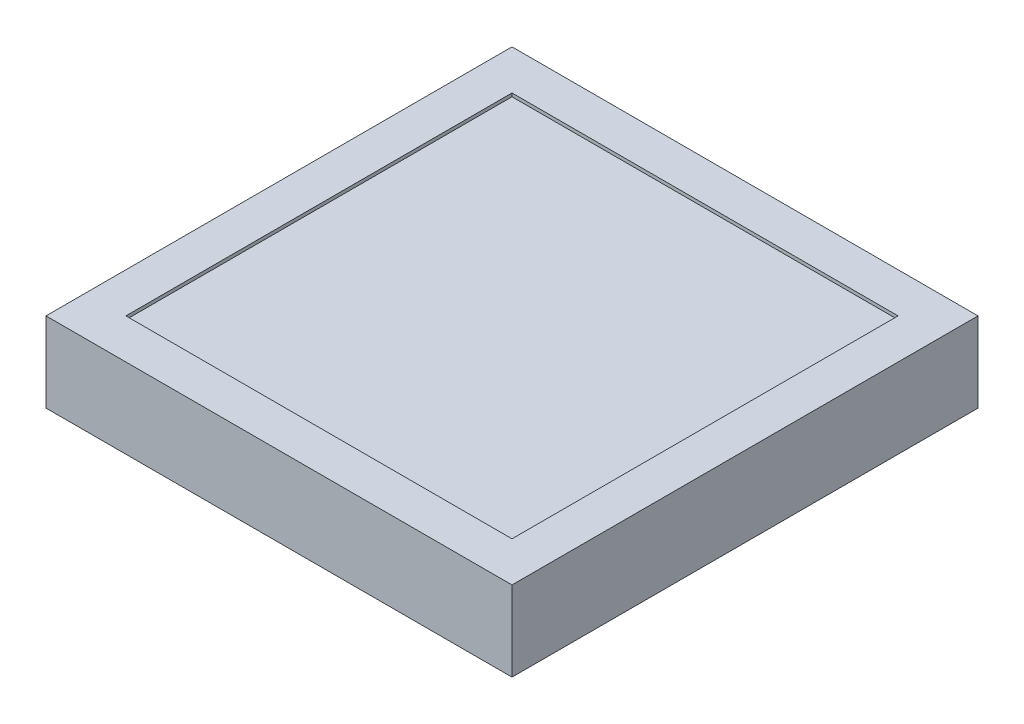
ISO-10303-21;
HEADER;
FILE_DESCRIPTION(('STEP AP214'),'2;1');
FILE_NAME('part.step','',(''),(''),'','','');
FILE_SCHEMA(('AUTOMOTIVE_DESIGN { 1 0 10303 214 1 1 1 1 }'));
ENDSEC;
DATA;
#1=APPLICATION_CONTEXT('core data for automotive mechanical design processes');
#2=APPLICATION_PROTOCOL_DEFINITION('international standard','automotive_design',2000,#1);
#3=PRODUCT_CONTEXT('',#1,'mechanical');
#4=PRODUCT('Part','Part','',(#3));
#5=PRODUCT_RELATED_PRODUCT_CATEGORY('part','',(#4));
#6=PRODUCT_DEFINITION_FORMATION('','',#4);
#7=PRODUCT_DEFINITION_CONTEXT('part definition',#1,'design');
#8=PRODUCT_DEFINITION('design','',#6,#7);
#9=PRODUCT_DEFINITION_SHAPE('','',#8);
#10=(LENGTH_UNIT() NAMED_UNIT(*) SI_UNIT(.MILLI.,.METRE.));
#11=(NAMED_UNIT(*) PLANE_ANGLE_UNIT() SI_UNIT($,.RADIAN.));
#12=(NAMED_UNIT(*) SI_UNIT($,.STERADIAN.) SOLID_ANGLE_UNIT());
#13=UNCERTAINTY_MEASURE_WITH_UNIT(LENGTH_MEASURE(1.E-05),#10,'distance_accuracy_value','');
#14=(GEOMETRIC_REPRESENTATION_CONTEXT(3) GLOBAL_UNCERTAINTY_ASSIGNED_CONTEXT((#13)) GLOBAL_UNIT_ASSIGNED_CONTEXT((#10,
#11,#12)) REPRESENTATION_CONTEXT('',''));
#15=CARTESIAN_POINT('',(0.,0.,0.));
#16=DIRECTION('',(0.,0.,1.));
#17=DIRECTION('',(1.,0.,0.));
#18=AXIS2_PLACEMENT_3D('',#15,#16,#17);
#19=CARTESIAN_POINT('',(144.143471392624,24.,145.254894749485));
#20=DIRECTION('',(-1.,0.,0.));
#21=DIRECTION('',(0.,0.,1.));
#22=AXIS2_PLACEMENT_3D('',#19,#20,#21);
#23=PLANE('',#22);
#24=DIRECTION('',(0.,0.,-1.));
#25=VECTOR('',#24,1.);
#26=CARTESIAN_POINT('',(144.143471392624,0.,145.254894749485));
#27=LINE('',#26,#25);
#28=CARTESIAN_POINT('',(144.143471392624,0.,145.254894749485));
#29=VERTEX_POINT('',#28);
#30=CARTESIAN_POINT('',(144.143471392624,0.,5.25489474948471));
#31=VERTEX_POINT('',#30);
#32=EDGE_CURVE('E158',#29,#31,#27,.T.);
#33=ORIENTED_EDGE('',*,*,#32,.T.);
#34=DIRECTION('',(0.,-1.,0.));
#35=VECTOR('',#34,1.);
#36=CARTESIAN_POINT('',(144.143471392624,24.,5.25489474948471));
#37=LINE('',#36,#35);
#38=CARTESIAN_POINT('',(144.143471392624,24.,5.25489474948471));
#39=VERTEX_POINT('',#38);
#40=EDGE_CURVE('E11',#39,#31,#37,.T.);
#41=ORIENTED_EDGE('',*,*,#40,.F.);
#42=DIRECTION('',(0.,0.,-1.));
#43=VECTOR('',#42,1.);
#44=CARTESIAN_POINT('',(144.143471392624,24.,145.254894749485));
#45=LINE('',#44,#43);
#46=CARTESIAN_POINT('',(144.143471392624,24.,145.254894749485));
#47=VERTEX_POINT('',#46);
#48=EDGE_CURVE('E164',#47,#39,#45,.T.);
#49=ORIENTED_EDGE('',*,*,#48,.F.);
#50=DIRECTION('',(0.,-1.,0.));
#51=VECTOR('',#50,1.);
#52=CARTESIAN_POINT('',(144.143471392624,24.,145.254894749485));
#53=LINE('',#52,#51);
#54=EDGE_CURVE('E174',#47,#29,#53,.T.);
#55=ORIENTED_EDGE('',*,*,#54,.T.);
#56=EDGE_LOOP('',(#33,#41,#49,#55));
#57=FACE_BOUND('',#56,.T.);
#58=ADVANCED_FACE('F39',(#57),#23,.F.);
#59=CARTESIAN_POINT('',(4.14347139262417,24.,5.25489474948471));
#60=DIRECTION('',(0.,0.,1.));
#61=DIRECTION('',(1.,0.,0.));
#62=AXIS2_PLACEMENT_3D('',#59,#60,#61);
#63=PLANE('',#62);
#64=DIRECTION('',(-1.,0.,0.));
#65=VECTOR('',#64,1.);
#66=CARTESIAN_POINT('',(4.14347139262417,0.,5.25489474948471));
#67=LINE('',#66,#65);
#68=CARTESIAN_POINT('',(4.14347139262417,0.,5.25489474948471));
#69=VERTEX_POINT('',#68);
#70=EDGE_CURVE('E178',#31,#69,#67,.T.);
#71=ORIENTED_EDGE('',*,*,#70,.T.);
#72=DIRECTION('',(0.,-1.,0.));
#73=VECTOR('',#72,1.);
#74=CARTESIAN_POINT('',(4.14347139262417,24.,5.25489474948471));
#75=LINE('',#74,#73);
#76=CARTESIAN_POINT('',(4.14347139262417,24.,5.25489474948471));
#77=VERTEX_POINT('',#76);
#78=EDGE_CURVE('E47',#77,#69,#75,.T.);
#79=ORIENTED_EDGE('',*,*,#78,.F.);
#80=DIRECTION('',(-1.,0.,0.));
#81=VECTOR('',#80,1.);
#82=CARTESIAN_POINT('',(4.14347139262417,24.,5.25489474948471));
#83=LINE('',#82,#81);
#84=EDGE_CURVE('E91',#39,#77,#83,.T.);
#85=ORIENTED_EDGE('',*,*,#84,.F.);
#86=ORIENTED_EDGE('',*,*,#40,.T.);
#87=EDGE_LOOP('',(#71,#79,#85,#86));
#88=FACE_BOUND('',#87,.T.);
#89=ADVANCED_FACE('F213',(#88),#63,.F.);
#90=CARTESIAN_POINT('',(4.14347139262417,24.,145.254894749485));
#91=DIRECTION('',(1.,0.,0.));
#92=DIRECTION('',(0.,0.,-1.));
#93=AXIS2_PLACEMENT_3D('',#90,#91,#92);
#94=PLANE('',#93);
#95=DIRECTION('',(0.,0.,1.));
#96=VECTOR('',#95,1.);
#97=CARTESIAN_POINT('',(4.14347139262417,0.,145.254894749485));
#98=LINE('',#97,#96);
#99=CARTESIAN_POINT('',(4.14347139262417,0.,145.254894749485));
#100=VERTEX_POINT('',#99);
#101=EDGE_CURVE('E181',#69,#100,#98,.T.);
#102=ORIENTED_EDGE('',*,*,#101,.T.);
#103=DIRECTION('',(0.,-1.,0.));
#104=VECTOR('',#103,1.);
#105=CARTESIAN_POINT('',(4.14347139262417,24.,145.254894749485));
#106=LINE('',#105,#104);
#107=CARTESIAN_POINT('',(4.14347139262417,24.,145.254894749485));
#108=VERTEX_POINT('',#107);
#109=EDGE_CURVE('E188',#108,#100,#106,.T.);
#110=ORIENTED_EDGE('',*,*,#109,.F.);
#111=DIRECTION('',(0.,0.,1.));
#112=VECTOR('',#111,1.);
#113=CARTESIAN_POINT('',(4.14347139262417,24.,145.254894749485));
#114=LINE('',#113,#112);
#115=EDGE_CURVE('E169',#77,#108,#114,.T.);
#116=ORIENTED_EDGE('',*,*,#115,.F.);
#117=ORIENTED_EDGE('',*,*,#78,.T.);
#118=EDGE_LOOP('',(#102,#110,#116,#117));
#119=FACE_BOUND('',#118,.T.);
#120=ADVANCED_FACE('F195',(#119),#94,.F.);
#121=CARTESIAN_POINT('',(4.14347139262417,24.,145.254894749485));
#122=DIRECTION('',(0.,0.,-1.));
#123=DIRECTION('',(-1.,0.,0.));
#124=AXIS2_PLACEMENT_3D('',#121,#122,#123);
#125=PLANE('',#124);
#126=DIRECTION('',(1.,0.,0.));
#127=VECTOR('',#126,1.);
#128=CARTESIAN_POINT('',(4.14347139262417,0.,145.254894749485));
#129=LINE('',#128,#127);
#130=EDGE_CURVE('E84',#100,#29,#129,.T.);
#131=ORIENTED_EDGE('',*,*,#130,.T.);
#132=ORIENTED_EDGE('',*,*,#54,.F.);
#133=DIRECTION('',(1.,0.,0.));
#134=VECTOR('',#133,1.);
#135=CARTESIAN_POINT('',(4.14347139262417,24.,145.254894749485));
#136=LINE('',#135,#134);
#137=EDGE_CURVE('E63',#108,#47,#136,.T.);
#138=ORIENTED_EDGE('',*,*,#137,.F.);
#139=ORIENTED_EDGE('',*,*,#109,.T.);
#140=EDGE_LOOP('',(#131,#132,#138,#139));
#141=FACE_BOUND('',#140,.T.);
#142=ADVANCED_FACE('F203',(#141),#125,.F.);
#143=CARTESIAN_POINT('',(0.,24.,0.));
#144=DIRECTION('',(0.,-1.,0.));
#145=DIRECTION('',(0.,0.,-1.));
#146=AXIS2_PLACEMENT_3D('',#143,#144,#145);
#147=PLANE('',#146);
#148=DIRECTION('',(-1.,0.,0.));
#149=VECTOR('',#148,1.);
#150=CARTESIAN_POINT('',(16.1434713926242,24.,17.2548947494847));
#151=LINE('',#150,#149);
#152=CARTESIAN_POINT('',(132.143471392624,24.,17.2548947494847));
#153=VERTEX_POINT('',#152);
#154=CARTESIAN_POINT('',(16.1434713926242,24.,17.2548947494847));
#155=VERTEX_POINT('',#154);
#156=EDGE_CURVE('E149',#153,#155,#151,.T.);
#157=ORIENTED_EDGE('',*,*,#156,.F.);
#158=DIRECTION('',(0.,0.,-1.));
#159=VECTOR('',#158,1.);
#160=CARTESIAN_POINT('',(132.143471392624,24.,133.254894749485));
#161=LINE('',#160,#159);
#162=CARTESIAN_POINT('',(132.143471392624,24.,133.254894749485));
#163=VERTEX_POINT('',#162);
#164=EDGE_CURVE('E54',#163,#153,#161,.T.);
#165=ORIENTED_EDGE('',*,*,#164,.F.);
#166=DIRECTION('',(1.,0.,0.));
#167=VECTOR('',#166,1.);
#168=CARTESIAN_POINT('',(16.1434713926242,24.,133.254894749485));
#169=LINE('',#168,#167);
#170=CARTESIAN_POINT('',(16.1434713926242,24.,133.254894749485));
#171=VERTEX_POINT('',#170);
#172=EDGE_CURVE('E136',#171,#163,#169,.T.);
#173=ORIENTED_EDGE('',*,*,#172,.F.);
#174=DIRECTION('',(0.,0.,1.));
#175=VECTOR('',#174,1.);
#176=CARTESIAN_POINT('',(16.1434713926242,24.,133.254894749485));
#177=LINE('',#176,#175);
#178=EDGE_CURVE('E140',#155,#171,#177,.T.);
#179=ORIENTED_EDGE('',*,*,#178,.F.);
#180=EDGE_LOOP('',(#157,#165,#173,#179));
#181=FACE_BOUND('',#180,.T.);
#182=ORIENTED_EDGE('',*,*,#48,.T.);
#183=ORIENTED_EDGE('',*,*,#84,.T.);
#184=ORIENTED_EDGE('',*,*,#115,.T.);
#185=ORIENTED_EDGE('',*,*,#137,.T.);
#186=EDGE_LOOP('',(#182,#183,#184,#185));
#187=FACE_BOUND('',#186,.T.);
#188=ADVANCED_FACE('F205',(#181,#187),#147,.F.);
#189=CARTESIAN_POINT('',(0.,0.,0.));
#190=DIRECTION('',(0.,-1.,0.));
#191=DIRECTION('',(0.,0.,-1.));
#192=AXIS2_PLACEMENT_3D('',#189,#190,#191);
#193=PLANE('',#192);
#194=ORIENTED_EDGE('',*,*,#32,.F.);
#195=ORIENTED_EDGE('',*,*,#130,.F.);
#196=ORIENTED_EDGE('',*,*,#101,.F.);
#197=ORIENTED_EDGE('',*,*,#70,.F.);
#198=EDGE_LOOP('',(#194,#195,#196,#197));
#199=FACE_BOUND('',#198,.T.);
#200=ADVANCED_FACE('F199',(#199),#193,.T.);
#201=CARTESIAN_POINT('',(132.143471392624,23.,133.254894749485));
#202=DIRECTION('',(1.,0.,0.));
#203=DIRECTION('',(0.,0.,-1.));
#204=AXIS2_PLACEMENT_3D('',#201,#202,#203);
#205=PLANE('',#204);
#206=ORIENTED_EDGE('',*,*,#164,.T.);
#207=DIRECTION('',(0.,1.,0.));
#208=VECTOR('',#207,1.);
#209=CARTESIAN_POINT('',(132.143471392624,23.,17.2548947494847));
#210=LINE('',#209,#208);
#211=CARTESIAN_POINT('',(132.143471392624,23.,17.2548947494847));
#212=VERTEX_POINT('',#211);
#213=EDGE_CURVE('E111',#212,#153,#210,.T.);
#214=ORIENTED_EDGE('',*,*,#213,.F.);
#215=DIRECTION('',(0.,0.,-1.));
#216=VECTOR('',#215,1.);
#217=CARTESIAN_POINT('',(132.143471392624,23.,133.254894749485));
#218=LINE('',#217,#216);
#219=CARTESIAN_POINT('',(132.143471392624,23.,133.254894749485));
#220=VERTEX_POINT('',#219);
#221=EDGE_CURVE('E115',#220,#212,#218,.T.);
#222=ORIENTED_EDGE('',*,*,#221,.F.);
#223=DIRECTION('',(0.,1.,0.));
#224=VECTOR('',#223,1.);
#225=CARTESIAN_POINT('',(132.143471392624,23.,133.254894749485));
#226=LINE('',#225,#224);
#227=EDGE_CURVE('E155',#220,#163,#226,.T.);
#228=ORIENTED_EDGE('',*,*,#227,.T.);
#229=EDGE_LOOP('',(#206,#214,#222,#228));
#230=FACE_BOUND('',#229,.T.);
#231=ADVANCED_FACE('F113',(#230),#205,.F.);
#232=CARTESIAN_POINT('',(16.1434713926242,23.,133.254894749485));
#233=DIRECTION('',(0.,0.,1.));
#234=DIRECTION('',(1.,0.,0.));
#235=AXIS2_PLACEMENT_3D('',#232,#233,#234);
#236=PLANE('',#235);
#237=ORIENTED_EDGE('',*,*,#172,.T.);
#238=ORIENTED_EDGE('',*,*,#227,.F.);
#239=DIRECTION('',(1.,0.,0.));
#240=VECTOR('',#239,1.);
#241=CARTESIAN_POINT('',(16.1434713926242,23.,133.254894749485));
#242=LINE('',#241,#240);
#243=CARTESIAN_POINT('',(16.1434713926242,23.,133.254894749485));
#244=VERTEX_POINT('',#243);
#245=EDGE_CURVE('E122',#244,#220,#242,.T.);
#246=ORIENTED_EDGE('',*,*,#245,.F.);
#247=DIRECTION('',(0.,1.,0.));
#248=VECTOR('',#247,1.);
#249=CARTESIAN_POINT('',(16.1434713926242,23.,133.254894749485));
#250=LINE('',#249,#248);
#251=EDGE_CURVE('E159',#244,#171,#250,.T.);
#252=ORIENTED_EDGE('',*,*,#251,.T.);
#253=EDGE_LOOP('',(#237,#238,#246,#252));
#254=FACE_BOUND('',#253,.T.);
#255=ADVANCED_FACE('F252',(#254),#236,.F.);
#256=CARTESIAN_POINT('',(16.1434713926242,23.,133.254894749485));
#257=DIRECTION('',(-1.,0.,0.));
#258=DIRECTION('',(0.,0.,1.));
#259=AXIS2_PLACEMENT_3D('',#256,#257,#258);
#260=PLANE('',#259);
#261=ORIENTED_EDGE('',*,*,#178,.T.);
#262=ORIENTED_EDGE('',*,*,#251,.F.);
#263=DIRECTION('',(0.,0.,1.));
#264=VECTOR('',#263,1.);
#265=CARTESIAN_POINT('',(16.1434713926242,23.,133.254894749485));
#266=LINE('',#265,#264);
#267=CARTESIAN_POINT('',(16.1434713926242,23.,17.2548947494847));
#268=VERTEX_POINT('',#267);
#269=EDGE_CURVE('E131',#268,#244,#266,.T.);
#270=ORIENTED_EDGE('',*,*,#269,.F.);
#271=DIRECTION('',(0.,1.,0.));
#272=VECTOR('',#271,1.);
#273=CARTESIAN_POINT('',(16.1434713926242,23.,17.2548947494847));
#274=LINE('',#273,#272);
#275=EDGE_CURVE('E121',#268,#155,#274,.T.);
#276=ORIENTED_EDGE('',*,*,#275,.T.);
#277=EDGE_LOOP('',(#261,#262,#270,#276));
#278=FACE_BOUND('',#277,.T.);
#279=ADVANCED_FACE('F261',(#278),#260,.F.);
#280=CARTESIAN_POINT('',(16.1434713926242,23.,17.2548947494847));
#281=DIRECTION('',(0.,0.,-1.));
#282=DIRECTION('',(-1.,0.,0.));
#283=AXIS2_PLACEMENT_3D('',#280,#281,#282);
#284=PLANE('',#283);
#285=ORIENTED_EDGE('',*,*,#156,.T.);
#286=ORIENTED_EDGE('',*,*,#275,.F.);
#287=DIRECTION('',(-1.,0.,0.));
#288=VECTOR('',#287,1.);
#289=CARTESIAN_POINT('',(16.1434713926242,23.,17.2548947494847));
#290=LINE('',#289,#288);
#291=EDGE_CURVE('E125',#212,#268,#290,.T.);
#292=ORIENTED_EDGE('',*,*,#291,.F.);
#293=ORIENTED_EDGE('',*,*,#213,.T.);
#294=EDGE_LOOP('',(#285,#286,#292,#293));
#295=FACE_BOUND('',#294,.T.);
#296=ADVANCED_FACE('F126',(#295),#284,.F.);
#297=CARTESIAN_POINT('',(0.,23.,0.));
#298=DIRECTION('',(0.,-1.,0.));
#299=DIRECTION('',(0.,0.,-1.));
#300=AXIS2_PLACEMENT_3D('',#297,#298,#299);
#301=PLANE('',#300);
#302=ORIENTED_EDGE('',*,*,#221,.T.);
#303=ORIENTED_EDGE('',*,*,#291,.T.);
#304=ORIENTED_EDGE('',*,*,#269,.T.);
#305=ORIENTED_EDGE('',*,*,#245,.T.);
#306=EDGE_LOOP('',(#302,#303,#304,#305));
#307=FACE_BOUND('',#306,.T.);
#308=ADVANCED_FACE('F133',(#307),#301,.F.);
#309=CLOSED_SHELL('',(#58,#89,#120,#142,#188,#200,#231,#255,#279,#296,#308));
#310=MANIFOLD_SOLID_BREP('B2',#309);
#311=ADVANCED_BREP_SHAPE_REPRESENTATION('',(#18,#310),#14);
#312=SHAPE_DEFINITION_REPRESENTATION(#9,#311);
ENDSEC;
END-ISO-10303-21;
